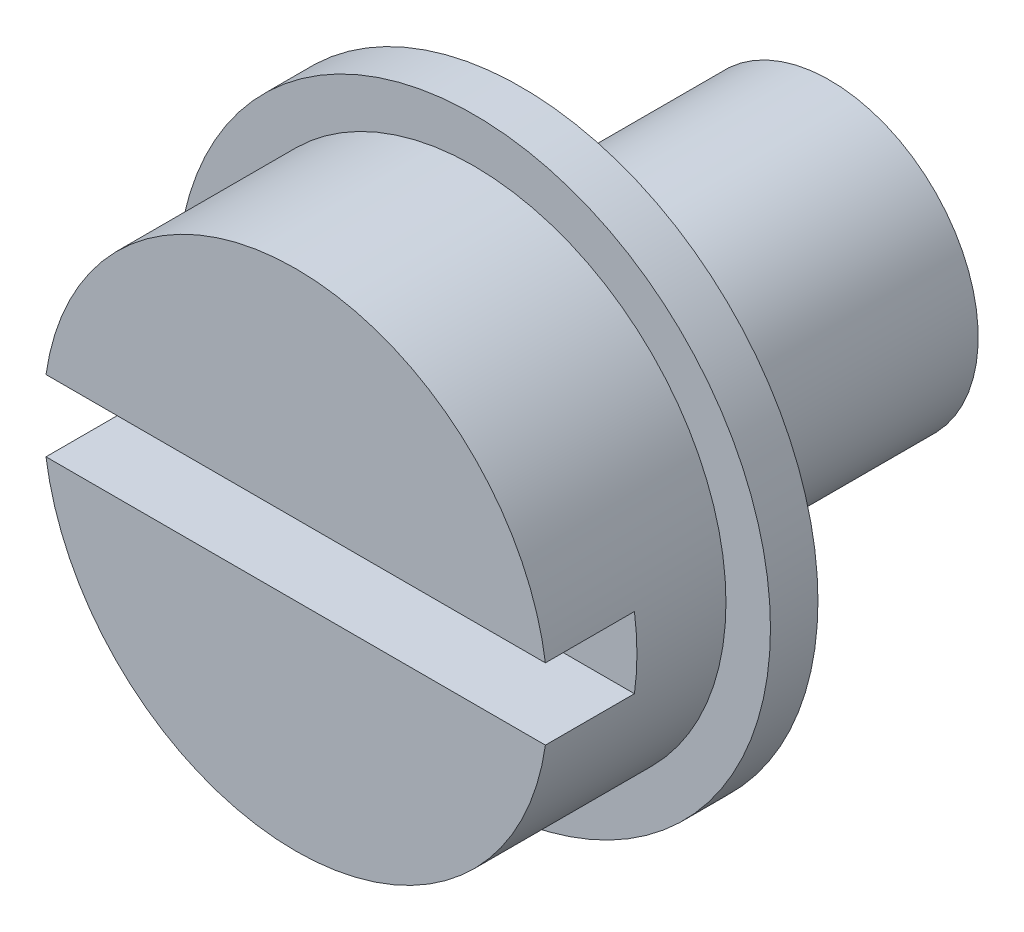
ISO-10303-21;
HEADER;
FILE_DESCRIPTION(('STEP AP214'),'2;1');
FILE_NAME('part.step','',(''),(''),'','','');
FILE_SCHEMA(('AUTOMOTIVE_DESIGN { 1 0 10303 214 1 1 1 1 }'));
ENDSEC;
DATA;
#1=APPLICATION_CONTEXT('core data for automotive mechanical design processes');
#2=APPLICATION_PROTOCOL_DEFINITION('international standard','automotive_design',2000,#1);
#3=PRODUCT_CONTEXT('',#1,'mechanical');
#4=PRODUCT('Part','Part','',(#3));
#5=PRODUCT_RELATED_PRODUCT_CATEGORY('part','',(#4));
#6=PRODUCT_DEFINITION_FORMATION('','',#4);
#7=PRODUCT_DEFINITION_CONTEXT('part definition',#1,'design');
#8=PRODUCT_DEFINITION('design','',#6,#7);
#9=PRODUCT_DEFINITION_SHAPE('','',#8);
#10=(LENGTH_UNIT() NAMED_UNIT(*) SI_UNIT(.MILLI.,.METRE.));
#11=(NAMED_UNIT(*) PLANE_ANGLE_UNIT() SI_UNIT($,.RADIAN.));
#12=(NAMED_UNIT(*) SI_UNIT($,.STERADIAN.) SOLID_ANGLE_UNIT());
#13=UNCERTAINTY_MEASURE_WITH_UNIT(LENGTH_MEASURE(1.E-05),#10,'distance_accuracy_value','');
#14=(GEOMETRIC_REPRESENTATION_CONTEXT(3) GLOBAL_UNCERTAINTY_ASSIGNED_CONTEXT((#13)) GLOBAL_UNIT_ASSIGNED_CONTEXT((#10,
#11,#12)) REPRESENTATION_CONTEXT('',''));
#15=CARTESIAN_POINT('',(0.,0.,0.));
#16=DIRECTION('',(0.,0.,1.));
#17=DIRECTION('',(1.,0.,0.));
#18=AXIS2_PLACEMENT_3D('',#15,#16,#17);
#19=CARTESIAN_POINT('',(0.,2.5,-5.2));
#20=DIRECTION('',(0.,0.,1.));
#21=DIRECTION('',(1.,0.,0.));
#22=AXIS2_PLACEMENT_3D('',#19,#20,#21);
#23=PLANE('',#22);
#24=CARTESIAN_POINT('',(0.,0.,-5.2));
#25=DIRECTION('',(0.,0.,-1.));
#26=DIRECTION('',(-1.,0.,0.));
#27=AXIS2_PLACEMENT_3D('',#24,#25,#26);
#28=CIRCLE('',#27,2.5);
#29=CARTESIAN_POINT('',(-2.5,0.,-5.2));
#30=VERTEX_POINT('',#29);
#31=EDGE_CURVE('E134',#30,#30,#28,.T.);
#32=ORIENTED_EDGE('',*,*,#31,.T.);
#33=EDGE_LOOP('',(#32));
#34=FACE_BOUND('',#33,.T.);
#35=ADVANCED_FACE('F14',(#34),#23,.F.);
#36=CARTESIAN_POINT('',(0.,0.,-59.2));
#37=DIRECTION('',(0.,0.,-1.));
#38=DIRECTION('',(-1.,0.,0.));
#39=AXIS2_PLACEMENT_3D('',#36,#37,#38);
#40=CYLINDRICAL_SURFACE('',#39,2.5);
#41=CARTESIAN_POINT('',(0.,0.,0.));
#42=DIRECTION('',(0.,0.,-1.));
#43=DIRECTION('',(-1.,0.,0.));
#44=AXIS2_PLACEMENT_3D('',#41,#42,#43);
#45=CIRCLE('',#44,2.5);
#46=CARTESIAN_POINT('',(-2.5,0.,0.));
#47=VERTEX_POINT('',#46);
#48=EDGE_CURVE('E9',#47,#47,#45,.T.);
#49=ORIENTED_EDGE('',*,*,#48,.T.);
#50=EDGE_LOOP('',(#49));
#51=FACE_BOUND('',#50,.T.);
#52=ORIENTED_EDGE('',*,*,#31,.F.);
#53=EDGE_LOOP('',(#52));
#54=FACE_BOUND('',#53,.T.);
#55=ADVANCED_FACE('F92',(#51,#54),#40,.T.);
#56=CARTESIAN_POINT('',(0.,0.,-59.2));
#57=DIRECTION('',(0.,0.,-1.));
#58=DIRECTION('',(-1.,0.,0.));
#59=AXIS2_PLACEMENT_3D('',#56,#57,#58);
#60=CYLINDRICAL_SURFACE('',#59,4.25);
#61=CARTESIAN_POINT('',(0.,0.,0.8));
#62=DIRECTION('',(0.,0.,-1.));
#63=DIRECTION('',(-1.,0.,0.));
#64=AXIS2_PLACEMENT_3D('',#61,#62,#63);
#65=CIRCLE('',#64,4.25);
#66=CARTESIAN_POINT('',(-4.25,0.,0.8));
#67=VERTEX_POINT('',#66);
#68=EDGE_CURVE('E128',#67,#67,#65,.T.);
#69=ORIENTED_EDGE('',*,*,#68,.F.);
#70=EDGE_LOOP('',(#69));
#71=FACE_BOUND('',#70,.T.);
#72=CARTESIAN_POINT('',(0.,0.,3.8));
#73=DIRECTION('',(0.,0.,-1.));
#74=DIRECTION('',(-1.,0.,0.));
#75=AXIS2_PLACEMENT_3D('',#72,#73,#74);
#76=CIRCLE('',#75,4.25);
#77=CARTESIAN_POINT('',(-4.20743389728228,0.6,3.8));
#78=VERTEX_POINT('',#77);
#79=CARTESIAN_POINT('',(4.20743389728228,0.6,3.8));
#80=VERTEX_POINT('',#79);
#81=EDGE_CURVE('E129',#78,#80,#76,.T.);
#82=ORIENTED_EDGE('',*,*,#81,.T.);
#83=DIRECTION('',(0.,0.,-1.));
#84=VECTOR('',#83,1.);
#85=CARTESIAN_POINT('',(4.20743389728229,0.6,-59.2));
#86=LINE('',#85,#84);
#87=CARTESIAN_POINT('',(4.20743389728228,0.6,2.3));
#88=VERTEX_POINT('',#87);
#89=EDGE_CURVE('E39',#80,#88,#86,.T.);
#90=ORIENTED_EDGE('',*,*,#89,.T.);
#91=CARTESIAN_POINT('',(0.,0.,2.3));
#92=DIRECTION('',(0.,0.,-1.));
#93=DIRECTION('',(0.,-1.,0.));
#94=AXIS2_PLACEMENT_3D('',#91,#92,#93);
#95=CIRCLE('',#94,4.25);
#96=CARTESIAN_POINT('',(4.20743389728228,-0.6,2.3));
#97=VERTEX_POINT('',#96);
#98=EDGE_CURVE('E23',#97,#88,#95,.F.);
#99=ORIENTED_EDGE('',*,*,#98,.F.);
#100=DIRECTION('',(0.,0.,-1.));
#101=VECTOR('',#100,1.);
#102=CARTESIAN_POINT('',(4.20743389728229,-0.6,-59.2));
#103=LINE('',#102,#101);
#104=CARTESIAN_POINT('',(4.20743389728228,-0.6,3.8));
#105=VERTEX_POINT('',#104);
#106=EDGE_CURVE('E57',#97,#105,#103,.F.);
#107=ORIENTED_EDGE('',*,*,#106,.T.);
#108=CARTESIAN_POINT('',(-4.20743389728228,-0.6,3.8));
#109=VERTEX_POINT('',#108);
#110=EDGE_CURVE('E131',#105,#109,#76,.T.);
#111=ORIENTED_EDGE('',*,*,#110,.T.);
#112=DIRECTION('',(0.,0.,-1.));
#113=VECTOR('',#112,1.);
#114=CARTESIAN_POINT('',(-4.20743389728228,-0.6,-59.2));
#115=LINE('',#114,#113);
#116=CARTESIAN_POINT('',(-4.20743389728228,-0.6,2.3));
#117=VERTEX_POINT('',#116);
#118=EDGE_CURVE('E31',#109,#117,#115,.T.);
#119=ORIENTED_EDGE('',*,*,#118,.T.);
#120=CARTESIAN_POINT('',(-4.20743389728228,0.6,2.3));
#121=VERTEX_POINT('',#120);
#122=EDGE_CURVE('E71',#121,#117,#95,.F.);
#123=ORIENTED_EDGE('',*,*,#122,.F.);
#124=DIRECTION('',(0.,0.,-1.));
#125=VECTOR('',#124,1.);
#126=CARTESIAN_POINT('',(-4.20743389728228,0.6,-59.2));
#127=LINE('',#126,#125);
#128=EDGE_CURVE('E136',#121,#78,#127,.F.);
#129=ORIENTED_EDGE('',*,*,#128,.T.);
#130=EDGE_LOOP('',(#82,#90,#99,#107,#111,#119,#123,#129));
#131=FACE_BOUND('',#130,.T.);
#132=ADVANCED_FACE('F75',(#71,#131),#60,.T.);
#133=CARTESIAN_POINT('',(0.,4.25,3.8));
#134=DIRECTION('',(0.,0.,1.));
#135=DIRECTION('',(1.,0.,0.));
#136=AXIS2_PLACEMENT_3D('',#133,#134,#135);
#137=PLANE('',#136);
#138=ORIENTED_EDGE('',*,*,#81,.F.);
#139=DIRECTION('',(1.,0.,0.));
#140=VECTOR('',#139,1.);
#141=CARTESIAN_POINT('',(0.,0.6,3.8));
#142=LINE('',#141,#140);
#143=EDGE_CURVE('E77',#78,#80,#142,.T.);
#144=ORIENTED_EDGE('',*,*,#143,.T.);
#145=EDGE_LOOP('',(#138,#144));
#146=FACE_BOUND('',#145,.T.);
#147=ADVANCED_FACE('F116',(#146),#137,.T.);
#148=ORIENTED_EDGE('',*,*,#110,.F.);
#149=DIRECTION('',(-1.,0.,0.));
#150=VECTOR('',#149,1.);
#151=CARTESIAN_POINT('',(0.,-0.6,3.8));
#152=LINE('',#151,#150);
#153=EDGE_CURVE('E61',#105,#109,#152,.T.);
#154=ORIENTED_EDGE('',*,*,#153,.T.);
#155=EDGE_LOOP('',(#148,#154));
#156=FACE_BOUND('',#155,.T.);
#157=ADVANCED_FACE('F119',(#156),#137,.T.);
#158=CARTESIAN_POINT('',(25.,0.6,2.3));
#159=DIRECTION('',(0.,0.,-1.));
#160=DIRECTION('',(0.,-1.,0.));
#161=AXIS2_PLACEMENT_3D('',#158,#159,#160);
#162=PLANE('',#161);
#163=ORIENTED_EDGE('',*,*,#98,.T.);
#164=DIRECTION('',(-1.,0.,0.));
#165=VECTOR('',#164,1.);
#166=CARTESIAN_POINT('',(25.,0.6,2.3));
#167=LINE('',#166,#165);
#168=EDGE_CURVE('E72',#88,#121,#167,.T.);
#169=ORIENTED_EDGE('',*,*,#168,.T.);
#170=ORIENTED_EDGE('',*,*,#122,.T.);
#171=DIRECTION('',(-1.,0.,0.));
#172=VECTOR('',#171,1.);
#173=CARTESIAN_POINT('',(25.,-0.6,2.3));
#174=LINE('',#173,#172);
#175=EDGE_CURVE('E60',#97,#117,#174,.T.);
#176=ORIENTED_EDGE('',*,*,#175,.F.);
#177=EDGE_LOOP('',(#163,#169,#170,#176));
#178=FACE_BOUND('',#177,.T.);
#179=ADVANCED_FACE('F68',(#178),#162,.F.);
#180=CARTESIAN_POINT('',(25.,0.6,2.3));
#181=DIRECTION('',(0.,-1.,0.));
#182=DIRECTION('',(0.,0.,1.));
#183=AXIS2_PLACEMENT_3D('',#180,#181,#182);
#184=PLANE('',#183);
#185=ORIENTED_EDGE('',*,*,#168,.F.);
#186=ORIENTED_EDGE('',*,*,#89,.F.);
#187=ORIENTED_EDGE('',*,*,#143,.F.);
#188=ORIENTED_EDGE('',*,*,#128,.F.);
#189=EDGE_LOOP('',(#185,#186,#187,#188));
#190=FACE_BOUND('',#189,.T.);
#191=ADVANCED_FACE('F99',(#190),#184,.T.);
#192=CARTESIAN_POINT('',(25.,-0.6,10.8));
#193=DIRECTION('',(0.,1.,0.));
#194=DIRECTION('',(0.,0.,-1.));
#195=AXIS2_PLACEMENT_3D('',#192,#193,#194);
#196=PLANE('',#195);
#197=ORIENTED_EDGE('',*,*,#175,.T.);
#198=ORIENTED_EDGE('',*,*,#118,.F.);
#199=ORIENTED_EDGE('',*,*,#153,.F.);
#200=ORIENTED_EDGE('',*,*,#106,.F.);
#201=EDGE_LOOP('',(#197,#198,#199,#200));
#202=FACE_BOUND('',#201,.T.);
#203=ADVANCED_FACE('F59',(#202),#196,.T.);
#204=CARTESIAN_POINT('',(0.,0.,0.));
#205=DIRECTION('',(0.,0.,1.));
#206=DIRECTION('',(1.,0.,0.));
#207=AXIS2_PLACEMENT_3D('',#204,#205,#206);
#208=CYLINDRICAL_SURFACE('',#207,5.);
#209=CARTESIAN_POINT('',(0.,0.,0.));
#210=DIRECTION('',(0.,0.,-1.));
#211=DIRECTION('',(-1.,0.,0.));
#212=AXIS2_PLACEMENT_3D('',#209,#210,#211);
#213=CIRCLE('',#212,5.);
#214=CARTESIAN_POINT('',(-5.,0.,0.));
#215=VERTEX_POINT('',#214);
#216=EDGE_CURVE('E18',#215,#215,#213,.T.);
#217=ORIENTED_EDGE('',*,*,#216,.F.);
#218=EDGE_LOOP('',(#217));
#219=FACE_BOUND('',#218,.T.);
#220=CARTESIAN_POINT('',(0.,0.,0.8));
#221=DIRECTION('',(0.,0.,-1.));
#222=DIRECTION('',(-1.,0.,0.));
#223=AXIS2_PLACEMENT_3D('',#220,#221,#222);
#224=CIRCLE('',#223,5.);
#225=CARTESIAN_POINT('',(-5.,0.,0.8));
#226=VERTEX_POINT('',#225);
#227=EDGE_CURVE('E80',#226,#226,#224,.T.);
#228=ORIENTED_EDGE('',*,*,#227,.T.);
#229=EDGE_LOOP('',(#228));
#230=FACE_BOUND('',#229,.T.);
#231=ADVANCED_FACE('F16',(#219,#230),#208,.T.);
#232=CARTESIAN_POINT('',(0.,0.,0.));
#233=DIRECTION('',(0.,0.,-1.));
#234=DIRECTION('',(-1.,0.,0.));
#235=AXIS2_PLACEMENT_3D('',#232,#233,#234);
#236=PLANE('',#235);
#237=ORIENTED_EDGE('',*,*,#216,.T.);
#238=EDGE_LOOP('',(#237));
#239=FACE_BOUND('',#238,.T.);
#240=ORIENTED_EDGE('',*,*,#48,.F.);
#241=EDGE_LOOP('',(#240));
#242=FACE_BOUND('',#241,.T.);
#243=ADVANCED_FACE('F87',(#239,#242),#236,.T.);
#244=CARTESIAN_POINT('',(0.,0.,0.8));
#245=DIRECTION('',(0.,0.,-1.));
#246=DIRECTION('',(-1.,0.,0.));
#247=AXIS2_PLACEMENT_3D('',#244,#245,#246);
#248=PLANE('',#247);
#249=ORIENTED_EDGE('',*,*,#68,.T.);
#250=EDGE_LOOP('',(#249));
#251=FACE_BOUND('',#250,.T.);
#252=ORIENTED_EDGE('',*,*,#227,.F.);
#253=EDGE_LOOP('',(#252));
#254=FACE_BOUND('',#253,.T.);
#255=ADVANCED_FACE('F91',(#251,#254),#248,.F.);
#256=CLOSED_SHELL('',(#35,#55,#132,#147,#157,#179,#191,#203,#231,#243,#255));
#257=MANIFOLD_SOLID_BREP('B1',#256);
#258=ADVANCED_BREP_SHAPE_REPRESENTATION('',(#18,#257),#14);
#259=SHAPE_DEFINITION_REPRESENTATION(#9,#258);
ENDSEC;
END-ISO-10303-21;
